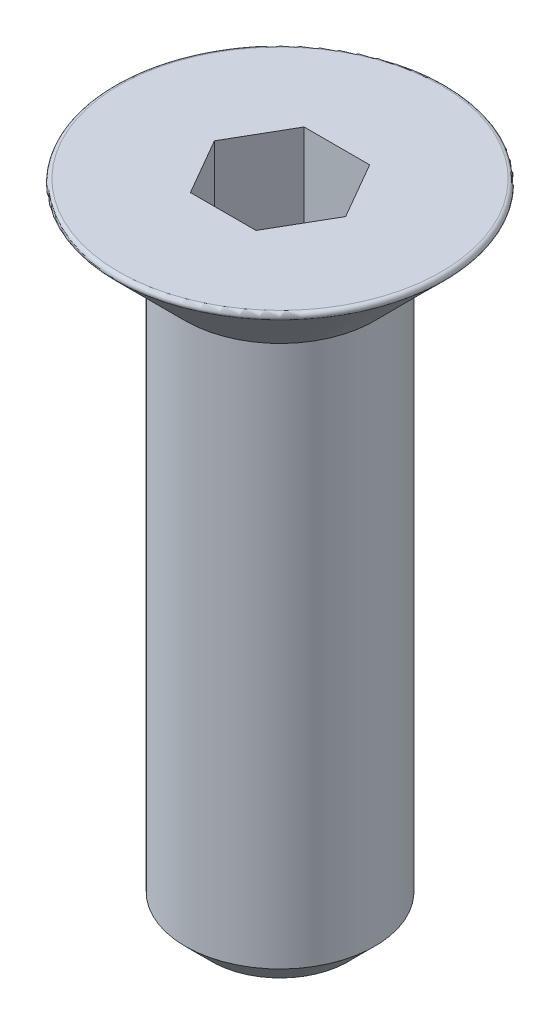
ISO-10303-21;
HEADER;
FILE_DESCRIPTION(('STEP AP214'),'2;1');
FILE_NAME('part.step','',(''),(''),'','','');
FILE_SCHEMA(('AUTOMOTIVE_DESIGN { 1 0 10303 214 1 1 1 1 }'));
ENDSEC;
DATA;
#1=APPLICATION_CONTEXT('core data for automotive mechanical design processes');
#2=APPLICATION_PROTOCOL_DEFINITION('international standard','automotive_design',2000,#1);
#3=PRODUCT_CONTEXT('',#1,'mechanical');
#4=PRODUCT('Part','Part','',(#3));
#5=PRODUCT_RELATED_PRODUCT_CATEGORY('part','',(#4));
#6=PRODUCT_DEFINITION_FORMATION('','',#4);
#7=PRODUCT_DEFINITION_CONTEXT('part definition',#1,'design');
#8=PRODUCT_DEFINITION('design','',#6,#7);
#9=PRODUCT_DEFINITION_SHAPE('','',#8);
#10=(LENGTH_UNIT() NAMED_UNIT(*) SI_UNIT(.MILLI.,.METRE.));
#11=(NAMED_UNIT(*) PLANE_ANGLE_UNIT() SI_UNIT($,.RADIAN.));
#12=(NAMED_UNIT(*) SI_UNIT($,.STERADIAN.) SOLID_ANGLE_UNIT());
#13=UNCERTAINTY_MEASURE_WITH_UNIT(LENGTH_MEASURE(1.E-05),#10,'distance_accuracy_value','');
#14=(GEOMETRIC_REPRESENTATION_CONTEXT(3) GLOBAL_UNCERTAINTY_ASSIGNED_CONTEXT((#13)) GLOBAL_UNIT_ASSIGNED_CONTEXT((#10,
#11,#12)) REPRESENTATION_CONTEXT('',''));
#15=CARTESIAN_POINT('',(0.,0.,0.));
#16=DIRECTION('',(0.,0.,1.));
#17=DIRECTION('',(1.,0.,0.));
#18=AXIS2_PLACEMENT_3D('',#15,#16,#17);
#19=CARTESIAN_POINT('',(0.,0.,0.));
#20=DIRECTION('',(0.,1.,0.));
#21=DIRECTION('',(0.,0.,1.));
#22=AXIS2_PLACEMENT_3D('',#19,#20,#21);
#23=PLANE('',#22);
#24=DIRECTION('',(0.5,0.,-0.866025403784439));
#25=VECTOR('',#24,1.);
#26=CARTESIAN_POINT('',(0.866025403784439,0.,1.5));
#27=LINE('',#26,#25);
#28=CARTESIAN_POINT('',(0.866025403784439,0.,1.5));
#29=VERTEX_POINT('',#28);
#30=CARTESIAN_POINT('',(1.73205080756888,0.,0.));
#31=VERTEX_POINT('',#30);
#32=EDGE_CURVE('E50',#29,#31,#27,.T.);
#33=ORIENTED_EDGE('',*,*,#32,.F.);
#34=DIRECTION('',(1.,0.,0.));
#35=VECTOR('',#34,1.);
#36=CARTESIAN_POINT('',(-0.866025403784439,0.,1.5));
#37=LINE('',#36,#35);
#38=CARTESIAN_POINT('',(-0.866025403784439,0.,1.5));
#39=VERTEX_POINT('',#38);
#40=EDGE_CURVE('E133',#39,#29,#37,.T.);
#41=ORIENTED_EDGE('',*,*,#40,.F.);
#42=DIRECTION('',(0.5,0.,0.866025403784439));
#43=VECTOR('',#42,1.);
#44=CARTESIAN_POINT('',(-1.73205080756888,0.,0.));
#45=LINE('',#44,#43);
#46=CARTESIAN_POINT('',(-1.73205080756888,0.,0.));
#47=VERTEX_POINT('',#46);
#48=EDGE_CURVE('E131',#47,#39,#45,.T.);
#49=ORIENTED_EDGE('',*,*,#48,.F.);
#50=DIRECTION('',(-0.5,0.,0.866025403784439));
#51=VECTOR('',#50,1.);
#52=CARTESIAN_POINT('',(-0.866025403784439,0.,-1.5));
#53=LINE('',#52,#51);
#54=CARTESIAN_POINT('',(-0.866025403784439,0.,-1.5));
#55=VERTEX_POINT('',#54);
#56=EDGE_CURVE('E98',#55,#47,#53,.T.);
#57=ORIENTED_EDGE('',*,*,#56,.F.);
#58=DIRECTION('',(-1.,0.,0.));
#59=VECTOR('',#58,1.);
#60=CARTESIAN_POINT('',(0.866025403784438,0.,-1.5));
#61=LINE('',#60,#59);
#62=CARTESIAN_POINT('',(0.866025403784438,0.,-1.5));
#63=VERTEX_POINT('',#62);
#64=EDGE_CURVE('E127',#63,#55,#61,.T.);
#65=ORIENTED_EDGE('',*,*,#64,.F.);
#66=DIRECTION('',(-0.5,0.,-0.866025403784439));
#67=VECTOR('',#66,1.);
#68=CARTESIAN_POINT('',(1.73205080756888,0.,0.));
#69=LINE('',#68,#67);
#70=EDGE_CURVE('E124',#31,#63,#69,.T.);
#71=ORIENTED_EDGE('',*,*,#70,.F.);
#72=EDGE_LOOP('',(#33,#41,#49,#57,#65,#71));
#73=FACE_BOUND('',#72,.T.);
#74=CARTESIAN_POINT('',(0.,0.,0.));
#75=DIRECTION('',(0.,1.,0.));
#76=DIRECTION('',(0.,0.,1.));
#77=AXIS2_PLACEMENT_3D('',#74,#75,#76);
#78=CIRCLE('',#77,4.25857864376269);
#79=CARTESIAN_POINT('',(0.,0.,4.25857864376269));
#80=VERTEX_POINT('',#79);
#81=EDGE_CURVE('E145',#80,#80,#78,.T.);
#82=ORIENTED_EDGE('',*,*,#81,.T.);
#83=EDGE_LOOP('',(#82));
#84=FACE_BOUND('',#83,.T.);
#85=ADVANCED_FACE('F35',(#73,#84),#23,.T.);
#86=CARTESIAN_POINT('',(0.,0.,0.));
#87=DIRECTION('',(0.,1.,0.));
#88=DIRECTION('',(0.,0.,1.));
#89=AXIS2_PLACEMENT_3D('',#86,#87,#88);
#90=CONICAL_SURFACE('',#89,4.5,0.78539816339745);
#91=CARTESIAN_POINT('',(0.,-0.170710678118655,0.));
#92=DIRECTION('',(0.,-1.,0.));
#93=DIRECTION('',(0.,0.,-1.));
#94=AXIS2_PLACEMENT_3D('',#91,#92,#93);
#95=CIRCLE('',#94,4.32928932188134);
#96=CARTESIAN_POINT('',(0.,-0.170710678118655,-4.32928932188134));
#97=VERTEX_POINT('',#96);
#98=EDGE_CURVE('E148',#97,#97,#95,.T.);
#99=ORIENTED_EDGE('',*,*,#98,.T.);
#100=EDGE_LOOP('',(#99));
#101=FACE_BOUND('',#100,.T.);
#102=CARTESIAN_POINT('',(0.,-1.99999999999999,0.));
#103=DIRECTION('',(0.,1.,0.));
#104=DIRECTION('',(0.,0.,1.));
#105=AXIS2_PLACEMENT_3D('',#102,#103,#104);
#106=CIRCLE('',#105,2.5);
#107=CARTESIAN_POINT('',(0.,-1.99999999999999,2.5));
#108=VERTEX_POINT('',#107);
#109=EDGE_CURVE('E137',#108,#108,#106,.T.);
#110=ORIENTED_EDGE('',*,*,#109,.T.);
#111=EDGE_LOOP('',(#110));
#112=FACE_BOUND('',#111,.T.);
#113=ADVANCED_FACE('F170',(#101,#112),#90,.T.);
#114=CARTESIAN_POINT('',(0.,15.4879719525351,0.));
#115=DIRECTION('',(0.,1.,0.));
#116=DIRECTION('',(0.,0.,1.));
#117=AXIS2_PLACEMENT_3D('',#114,#115,#116);
#118=CYLINDRICAL_SURFACE('',#117,2.5);
#119=CARTESIAN_POINT('',(0.,-16.3,0.));
#120=DIRECTION('',(0.,-1.,0.));
#121=DIRECTION('',(0.,0.,-1.));
#122=AXIS2_PLACEMENT_3D('',#119,#120,#121);
#123=CIRCLE('',#122,2.5);
#124=CARTESIAN_POINT('',(0.,-16.3,-2.5));
#125=VERTEX_POINT('',#124);
#126=EDGE_CURVE('E43',#125,#125,#123,.F.);
#127=ORIENTED_EDGE('',*,*,#126,.T.);
#128=EDGE_LOOP('',(#127));
#129=FACE_BOUND('',#128,.T.);
#130=ORIENTED_EDGE('',*,*,#109,.F.);
#131=EDGE_LOOP('',(#130));
#132=FACE_BOUND('',#131,.T.);
#133=ADVANCED_FACE('F153',(#129,#132),#118,.T.);
#134=CARTESIAN_POINT('',(2.5,-17.,0.));
#135=DIRECTION('',(0.,-1.,0.));
#136=DIRECTION('',(0.,0.,-1.));
#137=AXIS2_PLACEMENT_3D('',#134,#135,#136);
#138=PLANE('',#137);
#139=CARTESIAN_POINT('',(0.,-17.,0.));
#140=DIRECTION('',(0.,-1.,0.));
#141=DIRECTION('',(0.,0.,-1.));
#142=AXIS2_PLACEMENT_3D('',#139,#140,#141);
#143=CIRCLE('',#142,1.79999999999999);
#144=CARTESIAN_POINT('',(0.,-17.,-1.79999999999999));
#145=VERTEX_POINT('',#144);
#146=EDGE_CURVE('E11',#145,#145,#143,.T.);
#147=ORIENTED_EDGE('',*,*,#146,.T.);
#148=EDGE_LOOP('',(#147));
#149=FACE_BOUND('',#148,.T.);
#150=ADVANCED_FACE('F166',(#149),#138,.T.);
#151=CARTESIAN_POINT('',(0.,-0.1,0.));
#152=DIRECTION('',(0.,1.,0.));
#153=DIRECTION('',(0.,0.,1.));
#154=AXIS2_PLACEMENT_3D('',#151,#152,#153);
#155=TOROIDAL_SURFACE('',#154,4.25857864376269,0.1);
#156=ORIENTED_EDGE('',*,*,#98,.F.);
#157=EDGE_LOOP('',(#156));
#158=FACE_BOUND('',#157,.T.);
#159=ORIENTED_EDGE('',*,*,#81,.F.);
#160=EDGE_LOOP('',(#159));
#161=FACE_BOUND('',#160,.T.);
#162=ADVANCED_FACE('F158',(#158,#161),#155,.T.);
#163=CARTESIAN_POINT('',(0.,-16.3,0.));
#164=DIRECTION('',(0.,1.,0.));
#165=DIRECTION('',(0.,0.,1.));
#166=AXIS2_PLACEMENT_3D('',#163,#164,#165);
#167=CONICAL_SURFACE('',#166,2.5,0.785398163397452);
#168=ORIENTED_EDGE('',*,*,#146,.F.);
#169=EDGE_LOOP('',(#168));
#170=FACE_BOUND('',#169,.T.);
#171=ORIENTED_EDGE('',*,*,#126,.F.);
#172=EDGE_LOOP('',(#171));
#173=FACE_BOUND('',#172,.T.);
#174=ADVANCED_FACE('F37',(#170,#173),#167,.T.);
#175=CARTESIAN_POINT('',(0.866025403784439,-3.,1.5));
#176=DIRECTION('',(0.866025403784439,0.,0.5));
#177=DIRECTION('',(0.5,0.,-0.866025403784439));
#178=AXIS2_PLACEMENT_3D('',#175,#176,#177);
#179=PLANE('',#178);
#180=ORIENTED_EDGE('',*,*,#32,.T.);
#181=DIRECTION('',(0.,1.,0.));
#182=VECTOR('',#181,1.);
#183=CARTESIAN_POINT('',(1.73205080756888,-3.,0.));
#184=LINE('',#183,#182);
#185=CARTESIAN_POINT('',(1.73205080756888,-3.,0.));
#186=VERTEX_POINT('',#185);
#187=EDGE_CURVE('E80',#186,#31,#184,.T.);
#188=ORIENTED_EDGE('',*,*,#187,.F.);
#189=DIRECTION('',(0.5,0.,-0.866025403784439));
#190=VECTOR('',#189,1.);
#191=CARTESIAN_POINT('',(0.866025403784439,-3.,1.5));
#192=LINE('',#191,#190);
#193=CARTESIAN_POINT('',(0.866025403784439,-3.,1.5));
#194=VERTEX_POINT('',#193);
#195=EDGE_CURVE('E135',#194,#186,#192,.T.);
#196=ORIENTED_EDGE('',*,*,#195,.F.);
#197=DIRECTION('',(0.,1.,0.));
#198=VECTOR('',#197,1.);
#199=CARTESIAN_POINT('',(0.866025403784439,-3.,1.5));
#200=LINE('',#199,#198);
#201=EDGE_CURVE('E58',#194,#29,#200,.T.);
#202=ORIENTED_EDGE('',*,*,#201,.T.);
#203=EDGE_LOOP('',(#180,#188,#196,#202));
#204=FACE_BOUND('',#203,.T.);
#205=ADVANCED_FACE('F157',(#204),#179,.F.);
#206=CARTESIAN_POINT('',(-0.866025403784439,-3.,1.5));
#207=DIRECTION('',(0.,0.,1.));
#208=DIRECTION('',(1.,0.,0.));
#209=AXIS2_PLACEMENT_3D('',#206,#207,#208);
#210=PLANE('',#209);
#211=ORIENTED_EDGE('',*,*,#40,.T.);
#212=ORIENTED_EDGE('',*,*,#201,.F.);
#213=DIRECTION('',(1.,0.,0.));
#214=VECTOR('',#213,1.);
#215=CARTESIAN_POINT('',(-0.866025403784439,-3.,1.5));
#216=LINE('',#215,#214);
#217=CARTESIAN_POINT('',(-0.866025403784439,-3.,1.5));
#218=VERTEX_POINT('',#217);
#219=EDGE_CURVE('E110',#218,#194,#216,.T.);
#220=ORIENTED_EDGE('',*,*,#219,.F.);
#221=DIRECTION('',(0.,1.,0.));
#222=VECTOR('',#221,1.);
#223=CARTESIAN_POINT('',(-0.866025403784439,-3.,1.5));
#224=LINE('',#223,#222);
#225=EDGE_CURVE('E102',#218,#39,#224,.T.);
#226=ORIENTED_EDGE('',*,*,#225,.T.);
#227=EDGE_LOOP('',(#211,#212,#220,#226));
#228=FACE_BOUND('',#227,.T.);
#229=ADVANCED_FACE('F164',(#228),#210,.F.);
#230=CARTESIAN_POINT('',(-1.73205080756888,-3.,0.));
#231=DIRECTION('',(-0.866025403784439,0.,0.5));
#232=DIRECTION('',(0.5,0.,0.866025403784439));
#233=AXIS2_PLACEMENT_3D('',#230,#231,#232);
#234=PLANE('',#233);
#235=ORIENTED_EDGE('',*,*,#48,.T.);
#236=ORIENTED_EDGE('',*,*,#225,.F.);
#237=DIRECTION('',(0.5,0.,0.866025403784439));
#238=VECTOR('',#237,1.);
#239=CARTESIAN_POINT('',(-1.73205080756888,-3.,0.));
#240=LINE('',#239,#238);
#241=CARTESIAN_POINT('',(-1.73205080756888,-3.,0.));
#242=VERTEX_POINT('',#241);
#243=EDGE_CURVE('E106',#242,#218,#240,.T.);
#244=ORIENTED_EDGE('',*,*,#243,.F.);
#245=DIRECTION('',(0.,1.,0.));
#246=VECTOR('',#245,1.);
#247=CARTESIAN_POINT('',(-1.73205080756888,-3.,0.));
#248=LINE('',#247,#246);
#249=EDGE_CURVE('E91',#242,#47,#248,.T.);
#250=ORIENTED_EDGE('',*,*,#249,.T.);
#251=EDGE_LOOP('',(#235,#236,#244,#250));
#252=FACE_BOUND('',#251,.T.);
#253=ADVANCED_FACE('F107',(#252),#234,.F.);
#254=CARTESIAN_POINT('',(-0.866025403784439,-3.,-1.5));
#255=DIRECTION('',(-0.866025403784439,0.,-0.5));
#256=DIRECTION('',(-0.5,0.,0.866025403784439));
#257=AXIS2_PLACEMENT_3D('',#254,#255,#256);
#258=PLANE('',#257);
#259=ORIENTED_EDGE('',*,*,#56,.T.);
#260=ORIENTED_EDGE('',*,*,#249,.F.);
#261=DIRECTION('',(-0.5,0.,0.866025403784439));
#262=VECTOR('',#261,1.);
#263=CARTESIAN_POINT('',(-0.866025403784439,-3.,-1.5));
#264=LINE('',#263,#262);
#265=CARTESIAN_POINT('',(-0.866025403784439,-3.,-1.5));
#266=VERTEX_POINT('',#265);
#267=EDGE_CURVE('E95',#266,#242,#264,.T.);
#268=ORIENTED_EDGE('',*,*,#267,.F.);
#269=DIRECTION('',(0.,1.,0.));
#270=VECTOR('',#269,1.);
#271=CARTESIAN_POINT('',(-0.866025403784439,-3.,-1.5));
#272=LINE('',#271,#270);
#273=EDGE_CURVE('E103',#266,#55,#272,.T.);
#274=ORIENTED_EDGE('',*,*,#273,.T.);
#275=EDGE_LOOP('',(#259,#260,#268,#274));
#276=FACE_BOUND('',#275,.T.);
#277=ADVANCED_FACE('F93',(#276),#258,.F.);
#278=CARTESIAN_POINT('',(0.866025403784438,-3.,-1.5));
#279=DIRECTION('',(0.,0.,-1.));
#280=DIRECTION('',(-1.,0.,0.));
#281=AXIS2_PLACEMENT_3D('',#278,#279,#280);
#282=PLANE('',#281);
#283=ORIENTED_EDGE('',*,*,#64,.T.);
#284=ORIENTED_EDGE('',*,*,#273,.F.);
#285=DIRECTION('',(-1.,0.,0.));
#286=VECTOR('',#285,1.);
#287=CARTESIAN_POINT('',(0.866025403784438,-3.,-1.5));
#288=LINE('',#287,#286);
#289=CARTESIAN_POINT('',(0.866025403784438,-3.,-1.5));
#290=VERTEX_POINT('',#289);
#291=EDGE_CURVE('E116',#290,#266,#288,.T.);
#292=ORIENTED_EDGE('',*,*,#291,.F.);
#293=DIRECTION('',(0.,1.,0.));
#294=VECTOR('',#293,1.);
#295=CARTESIAN_POINT('',(0.866025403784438,-3.,-1.5));
#296=LINE('',#295,#294);
#297=EDGE_CURVE('E140',#290,#63,#296,.T.);
#298=ORIENTED_EDGE('',*,*,#297,.T.);
#299=EDGE_LOOP('',(#283,#284,#292,#298));
#300=FACE_BOUND('',#299,.T.);
#301=ADVANCED_FACE('F188',(#300),#282,.F.);
#302=CARTESIAN_POINT('',(1.73205080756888,-3.,0.));
#303=DIRECTION('',(0.866025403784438,0.,-0.5));
#304=DIRECTION('',(-0.5,0.,-0.866025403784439));
#305=AXIS2_PLACEMENT_3D('',#302,#303,#304);
#306=PLANE('',#305);
#307=ORIENTED_EDGE('',*,*,#70,.T.);
#308=ORIENTED_EDGE('',*,*,#297,.F.);
#309=DIRECTION('',(-0.5,0.,-0.866025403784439));
#310=VECTOR('',#309,1.);
#311=CARTESIAN_POINT('',(1.73205080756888,-3.,0.));
#312=LINE('',#311,#310);
#313=EDGE_CURVE('E118',#186,#290,#312,.T.);
#314=ORIENTED_EDGE('',*,*,#313,.F.);
#315=ORIENTED_EDGE('',*,*,#187,.T.);
#316=EDGE_LOOP('',(#307,#308,#314,#315));
#317=FACE_BOUND('',#316,.T.);
#318=ADVANCED_FACE('F185',(#317),#306,.F.);
#319=CARTESIAN_POINT('',(1.73205080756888,-3.,0.));
#320=DIRECTION('',(0.,1.,0.));
#321=DIRECTION('',(0.,0.,1.));
#322=AXIS2_PLACEMENT_3D('',#319,#320,#321);
#323=PLANE('',#322);
#324=ORIENTED_EDGE('',*,*,#195,.T.);
#325=ORIENTED_EDGE('',*,*,#313,.T.);
#326=ORIENTED_EDGE('',*,*,#291,.T.);
#327=ORIENTED_EDGE('',*,*,#267,.T.);
#328=ORIENTED_EDGE('',*,*,#243,.T.);
#329=ORIENTED_EDGE('',*,*,#219,.T.);
#330=EDGE_LOOP('',(#324,#325,#326,#327,#328,#329));
#331=FACE_BOUND('',#330,.T.);
#332=ADVANCED_FACE('F113',(#331),#323,.T.);
#333=CLOSED_SHELL('',(#85,#113,#133,#150,#162,#174,#205,#229,#253,#277,#301,#318,#332));
#334=MANIFOLD_SOLID_BREP('B2',#333);
#335=ADVANCED_BREP_SHAPE_REPRESENTATION('',(#18,#334),#14);
#336=SHAPE_DEFINITION_REPRESENTATION(#9,#335);
ENDSEC;
END-ISO-10303-21;
